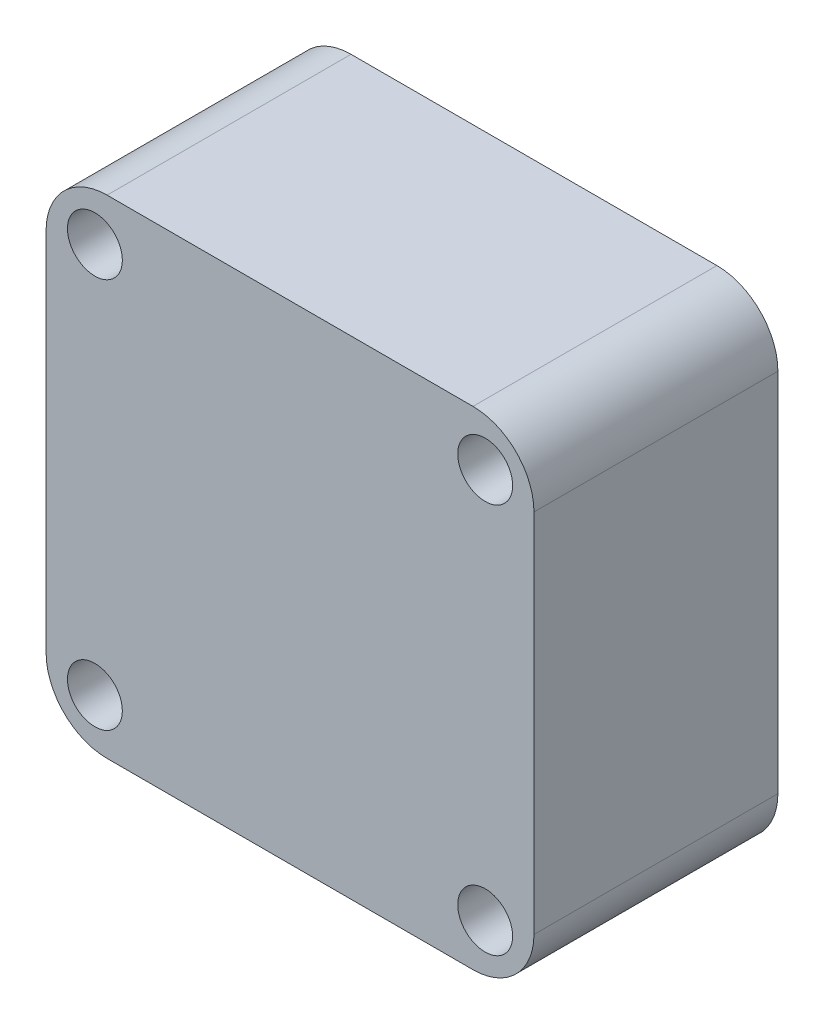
from build123d import *

# Parameters (mm, degrees)
SKICA1_W                = 40
SKICA1_H                = 40
SKICA1_R                = 2.25
P_IDAT_VYSUNUT_M1_DEPTH = 20
ZAOBLIT2_R              = 5
ZAOBLIT3_R              = 5


with BuildPart() as part:
    # Skica1 → P_idat vysunut_m1 (new body)
    with BuildSketch(Plane.XY):
        Rectangle(SKICA1_W, SKICA1_H)
        with Locations((-16, 16)):
            Circle(SKICA1_R, mode=Mode.SUBTRACT)
        with Locations((16, 16)):
            Circle(SKICA1_R, mode=Mode.SUBTRACT)
        with Locations((16, -16)):
            Circle(SKICA1_R, mode=Mode.SUBTRACT)
        with Locations((-16, -16)):
            Circle(SKICA1_R, mode=Mode.SUBTRACT)
    extrude(amount=P_IDAT_VYSUNUT_M1_DEPTH)

    # Zaoblit2
    zaoblit2_edges = [part.edges().sort_by_distance(p)[0] for p in [
        (-20, 20, 10),
    ]]
    fillet(zaoblit2_edges, radius=ZAOBLIT2_R)

    # Zaoblit3
    zaoblit3_edges = [part.edges().sort_by_distance(p)[0] for p in [
        (20, -20, 10),
        (-20, -20, 10),
        (20, 20, 10),
    ]]
    fillet(zaoblit3_edges, radius=ZAOBLIT3_R)


solid = part.part
